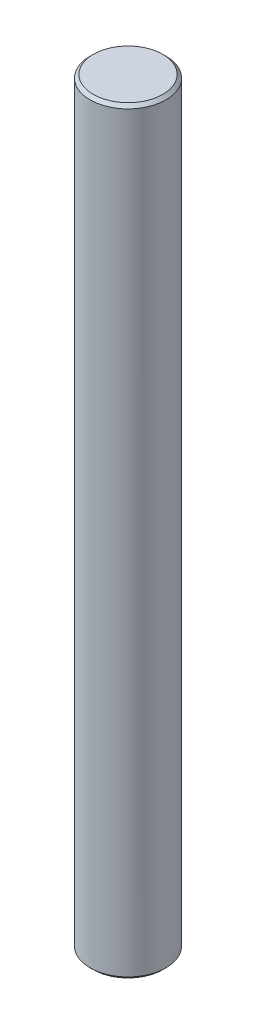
ISO-10303-21;
HEADER;
FILE_DESCRIPTION(('STEP AP214'),'2;1');
FILE_NAME('part.step','',(''),(''),'','','');
FILE_SCHEMA(('AUTOMOTIVE_DESIGN { 1 0 10303 214 1 1 1 1 }'));
ENDSEC;
DATA;
#1=APPLICATION_CONTEXT('core data for automotive mechanical design processes');
#2=APPLICATION_PROTOCOL_DEFINITION('international standard','automotive_design',2000,#1);
#3=PRODUCT_CONTEXT('',#1,'mechanical');
#4=PRODUCT('Part','Part','',(#3));
#5=PRODUCT_RELATED_PRODUCT_CATEGORY('part','',(#4));
#6=PRODUCT_DEFINITION_FORMATION('','',#4);
#7=PRODUCT_DEFINITION_CONTEXT('part definition',#1,'design');
#8=PRODUCT_DEFINITION('design','',#6,#7);
#9=PRODUCT_DEFINITION_SHAPE('','',#8);
#10=(LENGTH_UNIT() NAMED_UNIT(*) SI_UNIT(.MILLI.,.METRE.));
#11=(NAMED_UNIT(*) PLANE_ANGLE_UNIT() SI_UNIT($,.RADIAN.));
#12=(NAMED_UNIT(*) SI_UNIT($,.STERADIAN.) SOLID_ANGLE_UNIT());
#13=UNCERTAINTY_MEASURE_WITH_UNIT(LENGTH_MEASURE(1.E-05),#10,'distance_accuracy_value','');
#14=(GEOMETRIC_REPRESENTATION_CONTEXT(3) GLOBAL_UNCERTAINTY_ASSIGNED_CONTEXT((#13)) GLOBAL_UNIT_ASSIGNED_CONTEXT((#10,
#11,#12)) REPRESENTATION_CONTEXT('',''));
#15=CARTESIAN_POINT('',(0.,0.,0.));
#16=DIRECTION('',(0.,0.,1.));
#17=DIRECTION('',(1.,0.,0.));
#18=AXIS2_PLACEMENT_3D('',#15,#16,#17);
#19=CARTESIAN_POINT('',(0.,10.1000000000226,0.));
#20=DIRECTION('',(0.,-1.,0.));
#21=DIRECTION('',(0.,0.,-1.));
#22=AXIS2_PLACEMENT_3D('',#19,#20,#21);
#23=CONICAL_SURFACE('',#22,1.64999999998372,1.02974425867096);
#24=CARTESIAN_POINT('',(0.,11.091420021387,0.));
#25=VERTEX_POINT('',#24);
#26=VERTEX_LOOP('',#25);
#27=FACE_BOUND('',#26,.T.);
#28=CARTESIAN_POINT('',(0.,10.1,0.));
#29=DIRECTION('',(0.,-1.,0.));
#30=DIRECTION('',(0.,0.,-1.));
#31=AXIS2_PLACEMENT_3D('',#28,#29,#30);
#32=CIRCLE('',#31,1.64999999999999);
#33=CARTESIAN_POINT('',(0.,10.1,-1.64999999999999));
#34=VERTEX_POINT('',#33);
#35=EDGE_CURVE('E33',#34,#34,#32,.T.);
#36=ORIENTED_EDGE('',*,*,#35,.T.);
#37=EDGE_LOOP('',(#36));
#38=FACE_BOUND('',#37,.T.);
#39=ADVANCED_FACE('F17',(#27,#38),#23,.F.);
#40=CARTESIAN_POINT('',(0.,0.,0.));
#41=DIRECTION('',(0.,-1.,0.));
#42=DIRECTION('',(0.,0.,-1.));
#43=AXIS2_PLACEMENT_3D('',#40,#41,#42);
#44=CYLINDRICAL_SURFACE('',#43,1.64999999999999);
#45=ORIENTED_EDGE('',*,*,#35,.F.);
#46=EDGE_LOOP('',(#45));
#47=FACE_BOUND('',#46,.T.);
#48=CARTESIAN_POINT('',(0.,0.,0.));
#49=DIRECTION('',(0.,-1.,0.));
#50=DIRECTION('',(0.,0.,-1.));
#51=AXIS2_PLACEMENT_3D('',#48,#49,#50);
#52=CIRCLE('',#51,1.64999999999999);
#53=CARTESIAN_POINT('',(0.,0.,-1.64999999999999));
#54=VERTEX_POINT('',#53);
#55=EDGE_CURVE('E20',#54,#54,#52,.T.);
#56=ORIENTED_EDGE('',*,*,#55,.T.);
#57=EDGE_LOOP('',(#56));
#58=FACE_BOUND('',#57,.T.);
#59=ADVANCED_FACE('F30',(#47,#58),#44,.F.);
#60=CARTESIAN_POINT('',(0.,120.,0.));
#61=DIRECTION('',(0.,1.,0.));
#62=DIRECTION('',(0.,0.,1.));
#63=AXIS2_PLACEMENT_3D('',#60,#61,#62);
#64=PLANE('',#63);
#65=CARTESIAN_POINT('',(0.,119.999999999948,0.));
#66=DIRECTION('',(0.,-1.,0.));
#67=DIRECTION('',(0.,0.,-1.));
#68=AXIS2_PLACEMENT_3D('',#65,#66,#67);
#69=CIRCLE('',#68,5.49999999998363);
#70=CARTESIAN_POINT('',(0.,119.999999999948,-5.49999999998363));
#71=VERTEX_POINT('',#70);
#72=EDGE_CURVE('E37',#71,#71,#69,.T.);
#73=ORIENTED_EDGE('',*,*,#72,.F.);
#74=EDGE_LOOP('',(#73));
#75=FACE_BOUND('',#74,.T.);
#76=ADVANCED_FACE('F47',(#75),#64,.T.);
#77=CARTESIAN_POINT('',(0.,0.,0.));
#78=DIRECTION('',(0.,1.,0.));
#79=DIRECTION('',(0.,0.,1.));
#80=AXIS2_PLACEMENT_3D('',#77,#78,#79);
#81=PLANE('',#80);
#82=CARTESIAN_POINT('',(0.,0.,0.));
#83=DIRECTION('',(0.,1.,0.));
#84=DIRECTION('',(0.,0.,1.));
#85=AXIS2_PLACEMENT_3D('',#82,#83,#84);
#86=CIRCLE('',#85,5.49999999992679);
#87=CARTESIAN_POINT('',(0.,0.,5.49999999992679));
#88=VERTEX_POINT('',#87);
#89=EDGE_CURVE('E40',#88,#88,#86,.T.);
#90=ORIENTED_EDGE('',*,*,#89,.F.);
#91=EDGE_LOOP('',(#90));
#92=FACE_BOUND('',#91,.T.);
#93=ORIENTED_EDGE('',*,*,#55,.F.);
#94=EDGE_LOOP('',(#93));
#95=FACE_BOUND('',#94,.T.);
#96=ADVANCED_FACE('F49',(#92,#95),#81,.F.);
#97=CARTESIAN_POINT('',(0.,119.49999999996,0.));
#98=DIRECTION('',(0.,-1.,0.));
#99=DIRECTION('',(0.,0.,-1.));
#100=AXIS2_PLACEMENT_3D('',#97,#98,#99);
#101=CONICAL_SURFACE('',#100,6.00000000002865,0.785398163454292);
#102=CARTESIAN_POINT('',(0.,119.5,0.));
#103=DIRECTION('',(0.,-1.,0.));
#104=DIRECTION('',(0.,0.,-1.));
#105=AXIS2_PLACEMENT_3D('',#102,#103,#104);
#106=CIRCLE('',#105,6.);
#107=CARTESIAN_POINT('',(0.,119.5,-6.));
#108=VERTEX_POINT('',#107);
#109=EDGE_CURVE('E24',#108,#108,#106,.T.);
#110=ORIENTED_EDGE('',*,*,#109,.F.);
#111=EDGE_LOOP('',(#110));
#112=FACE_BOUND('',#111,.T.);
#113=ORIENTED_EDGE('',*,*,#72,.T.);
#114=EDGE_LOOP('',(#113));
#115=FACE_BOUND('',#114,.T.);
#116=ADVANCED_FACE('F45',(#112,#115),#101,.T.);
#117=CARTESIAN_POINT('',(0.,0.499999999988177,0.));
#118=DIRECTION('',(0.,1.,0.));
#119=DIRECTION('',(0.,0.,1.));
#120=AXIS2_PLACEMENT_3D('',#117,#118,#119);
#121=CONICAL_SURFACE('',#120,5.99999999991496,0.785398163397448);
#122=CARTESIAN_POINT('',(0.,0.500000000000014,0.));
#123=DIRECTION('',(0.,-1.,0.));
#124=DIRECTION('',(0.,0.,-1.));
#125=AXIS2_PLACEMENT_3D('',#122,#123,#124);
#126=CIRCLE('',#125,6.);
#127=CARTESIAN_POINT('',(0.,0.500000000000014,-6.));
#128=VERTEX_POINT('',#127);
#129=EDGE_CURVE('E11',#128,#128,#126,.F.);
#130=ORIENTED_EDGE('',*,*,#129,.F.);
#131=EDGE_LOOP('',(#130));
#132=FACE_BOUND('',#131,.T.);
#133=ORIENTED_EDGE('',*,*,#89,.T.);
#134=EDGE_LOOP('',(#133));
#135=FACE_BOUND('',#134,.T.);
#136=ADVANCED_FACE('F60',(#132,#135),#121,.T.);
#137=CARTESIAN_POINT('',(0.,120.,0.));
#138=DIRECTION('',(0.,-1.,0.));
#139=DIRECTION('',(0.,0.,-1.));
#140=AXIS2_PLACEMENT_3D('',#137,#138,#139);
#141=CYLINDRICAL_SURFACE('',#140,6.);
#142=ORIENTED_EDGE('',*,*,#129,.T.);
#143=EDGE_LOOP('',(#142));
#144=FACE_BOUND('',#143,.T.);
#145=ORIENTED_EDGE('',*,*,#109,.T.);
#146=EDGE_LOOP('',(#145));
#147=FACE_BOUND('',#146,.T.);
#148=ADVANCED_FACE('F58',(#144,#147),#141,.T.);
#149=CLOSED_SHELL('',(#39,#59,#76,#96,#116,#136,#148));
#150=MANIFOLD_SOLID_BREP('B1',#149);
#151=ADVANCED_BREP_SHAPE_REPRESENTATION('',(#18,#150),#14);
#152=SHAPE_DEFINITION_REPRESENTATION(#9,#151);
ENDSEC;
END-ISO-10303-21;
